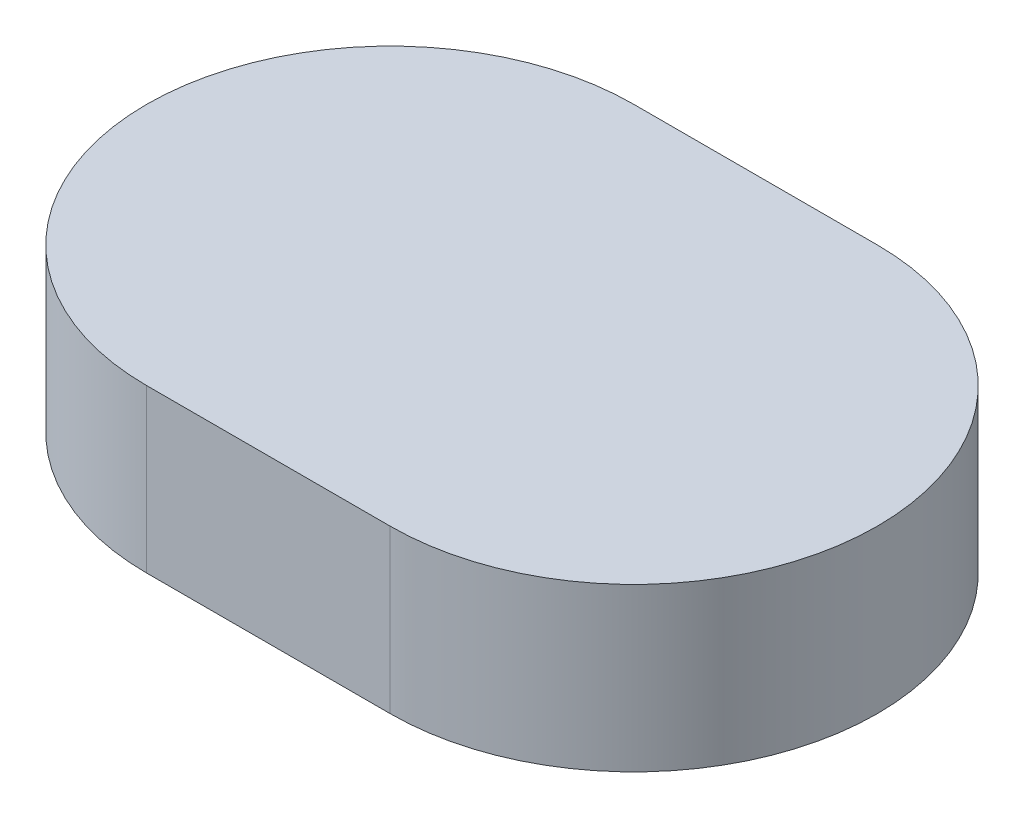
from build123d import *

# Parameters (mm, degrees)
BOSS_EXTRU_1_DEPTH = 2


with BuildPart() as part:
    # Esquisse1 → Boss.-Extru.1 (new body)
    with BuildSketch(Plane(origin=(0, 0, 0), x_dir=(1, 0, 0), z_dir=(0, 1, 0))):
        with BuildLine():
            Line((-1.5, 3), (1.5, 3))
            ThreePointArc((1.5, 3), (4.5, 0), (1.5, -3))
            Line((1.5, -3), (-1.5, -3))
            ThreePointArc((-1.5, -3), (-4.5, 0), (-1.5, 3))
        make_face()
    extrude(amount=BOSS_EXTRU_1_DEPTH)


solid = part.part
